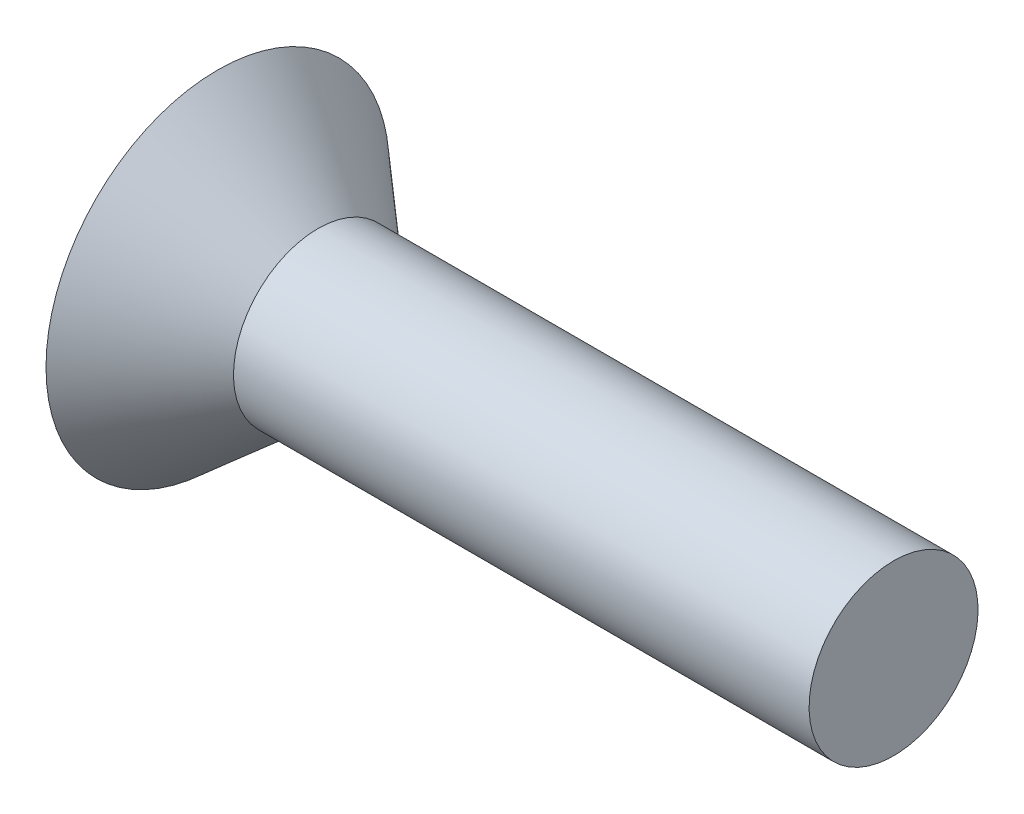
from build123d import *

# Parameters (mm, degrees)
CUT_EXTRUDE1_DEPTH = 4.064


with BuildPart() as part:
    # Sketch1 → Revolve1 (revolve)
    with BuildSketch(Plane.XY):
        Polygon((38.1, 0), (0, 0), (0, 9.6774), (5.653945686, 4.7625), (38.1, 4.7625), align=None)
    revolve(axis=Axis((38.1, 0, 0), (-1, 0, 0)))

    # Sketch2 → Cut-Extrude1 (cut)
    with BuildSketch(Plane.ZY):
        Polygon((-2.7686, 1.598451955), (-2.7686, -1.598451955), (0, -3.196903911), (2.7686, -1.598451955), (2.7686, 1.598451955), (0, 3.196903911), align=None)
    extrude(amount=-CUT_EXTRUDE1_DEPTH, mode=Mode.SUBTRACT)


solid = part.part
